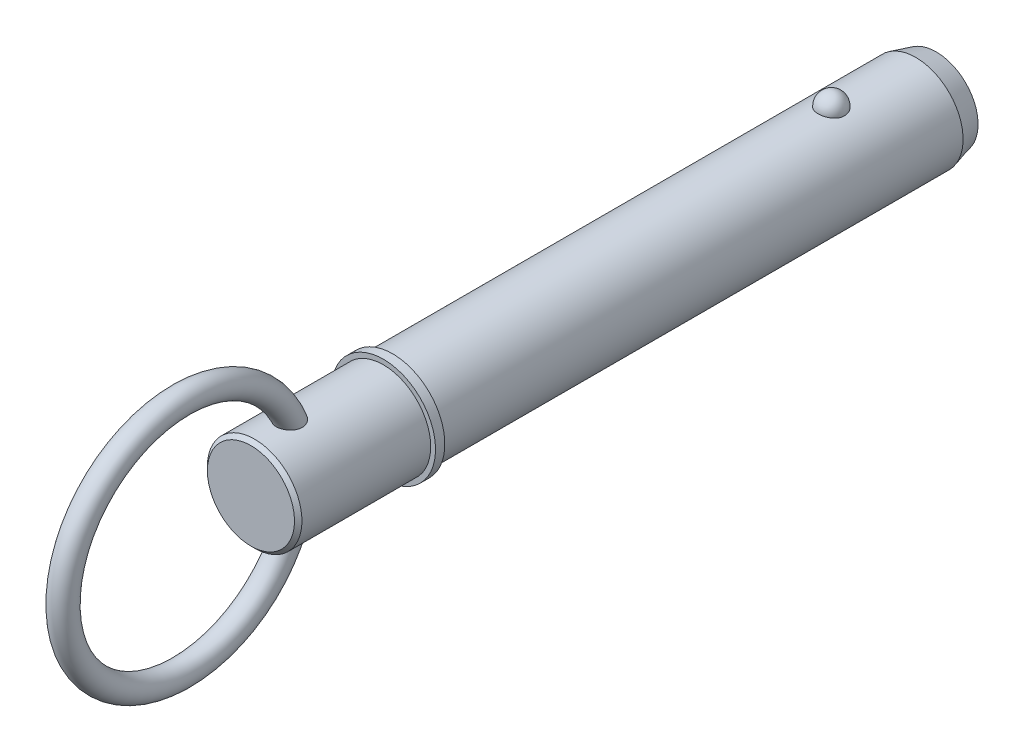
from build123d import *

# Parameters (mm, degrees)
SKETCH2_R           = 12.7
BOSS_EXTRUDE1_DEPTH = 114.3
BOSS_EXTRUDE2_START = 31.75
SKETCH3_R           = 12.7
BOSS_EXTRUDE2_DEPTH = 31.75
CHAMFER1_SIZE       = 5.5
CHAMFER1_SIZE2      = 1.473720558
SKETCH20_W          = 2.5
SKETCH20_H          = 14
SKETCH21_R          = 12.7
BOSS_EXTRUDE3_DEPTH = 38.1
CHAMFER2_SIZE       = 1
SKETCH24_R          = 3.25


with BuildPart() as part:
    # Sketch2 → Boss-Extrude1 (new body)
    with BuildSketch(Plane.XY):
        Circle(SKETCH2_R)
    extrude(amount=BOSS_EXTRUDE1_DEPTH)

    # Sketch3 → Boss-Extrude2 (add)
    with BuildSketch(Plane(origin=(0, 0, 0), x_dir=(-1, 0, 0), z_dir=(0, 0, -1)).offset(BOSS_EXTRUDE2_START)):
        Circle(SKETCH3_R)
    extrude(amount=-BOSS_EXTRUDE2_DEPTH)

    # Chamfer1
    chamfer1_edges = [part.edges().sort_by_distance(p)[0] for p in [
        (12.7, 0, -31.75),
    ]]
    chamfer1_side = [part.faces().sort_by_distance(p)[0] for p in [
        (12.7, 0, -15.875),
    ]]
    chamfer(chamfer1_edges, length=CHAMFER1_SIZE, length2=CHAMFER1_SIZE2, reference=chamfer1_side[0])

    # Sketch18 → Revolve1 (revolve)
    with BuildSketch(Plane(origin=(0, 0, 0), x_dir=(0, 0, -1), z_dir=(1, 0, 0))):
        with BuildLine():
            Line((3.56, 16.26), (3.56, 9.14))
            ThreePointArc((3.56, 9.14), (0, 12.7), (3.56, 16.26))
        make_face()
    revolve(axis=Axis((0, 16.26, -3.56), (0, -1, 0)))

    # Sketch20 → Revolve2 (revolve)
    with BuildSketch(Plane(origin=(0, 0, 0), x_dir=(0, 0, -1), z_dir=(1, 0, 0)), mode=Mode.PRIVATE) as revolve2_sk:
        with Locations((-115.55, 7)):
            Rectangle(SKETCH20_W, SKETCH20_H)
    revolve(revolve2_sk.sketch.rotate(Axis((0, 0, 33.728787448), (0, 0, 1)), 90), axis=Axis((0, 0, 33.728787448), (0, 0, 1)))

    # Sketch21 → Boss-Extrude3 (add)
    with BuildSketch(Plane(origin=(0, 0, 114.3), x_dir=(-1, 0, 0), z_dir=(0, 0, -1))):
        Circle(SKETCH21_R)
    extrude(amount=-BOSS_EXTRUDE3_DEPTH)

    # Chamfer2
    chamfer2_edges = [part.edges().sort_by_distance(p)[0] for p in [
        (12.7, 0, 152.4),
    ]]
    chamfer(chamfer2_edges, length=CHAMFER2_SIZE)

    # Sweep1: sweep along a path in Sketch23
    with BuildLine(Plane(origin=(0, 0, 0), x_dir=(0, 0, -1), z_dir=(1, 0, 0))) as sweep1_path:
        CenterArc((-171.15, 0), 31.75, 0, 360)
    # Sketch24 → Sweep1 (sweep)
    with BuildSketch(Plane(origin=(0, 0, 0), x_dir=(1, 0, 0), z_dir=(0, 1, 0))):
        with Locations((0, -139.4)):
            Circle(SKETCH24_R)
    sweep(path=sweep1_path.line)


solid = part.part
